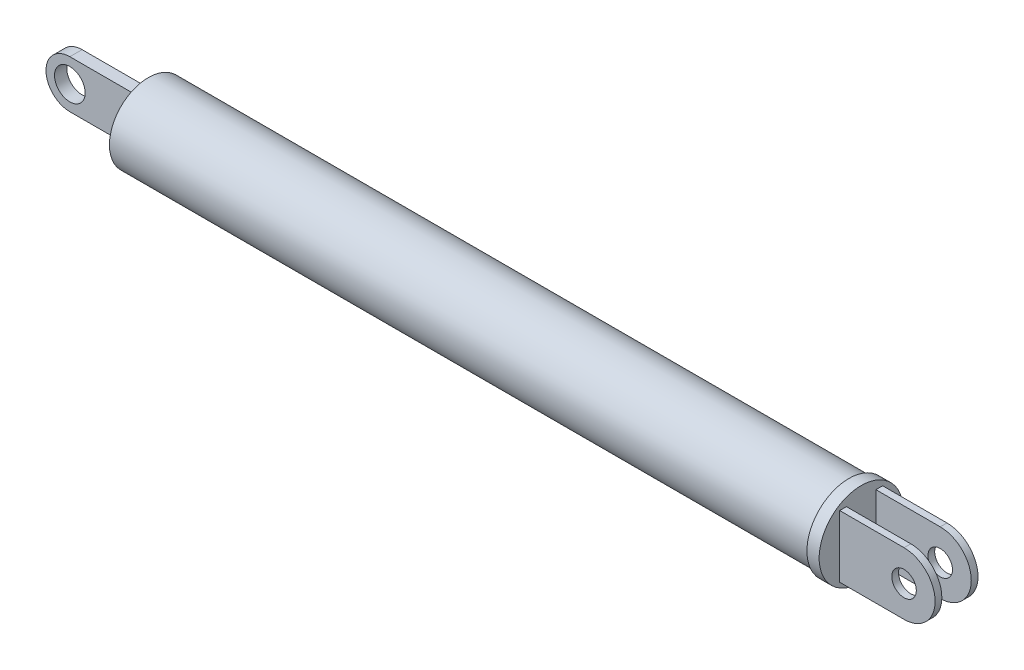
from build123d import *

# Parameters (mm, degrees)
SKETCH1_R               = 12.7
EXTRUDE1_DEPTH          = 228.6
SKETCH2_R               = 5
EXTRUDE2_DEPTH          = 2
SKETCH3_R               = 13.7
EXTRUDE3_DEPTH          = 4
SKETCH4_R               = 4
EXTRUDE4_DEPTH          = 7
CUT_EXTRUDE1_DEPTH      = 265.443561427
CUT_EXTRUDE1_DEPTH_BACK = 265.443561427
SKETCH5_W               = 127.127972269
SKETCH5_H               = 9.602426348


with BuildPart() as part:
    # Sketch1 → Extrude1 (new body)
    with BuildSketch(Plane(origin=(0, 0, 0), x_dir=(0, 0, -1), z_dir=(1, 0, 0))):
        with Locations(Location((0, 0, 0), (0, 0, 180))):
            Circle(SKETCH1_R)
    extrude(amount=EXTRUDE1_DEPTH)

    # Sketch2 → Extrude2 (add, symmetric)
    with BuildSketch(Plane.XY):
        with BuildLine():
            Line((0, 7.778067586), (-23.625125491, 7.778067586))
            ThreePointArc((-23.625125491, 7.778067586), (-31.403193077, 0), (-23.625125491, -7.778067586))
            Line((-23.625125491, -7.778067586), (0, -7.778067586))
            Line((0, -7.778067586), (0, 7.778067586))
        make_face()
        with Locations((-23.625125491, 0)):
            Circle(SKETCH2_R, mode=Mode.SUBTRACT)
    extrude(amount=EXTRUDE2_DEPTH, both=True)

    # Sketch3 → Extrude3 (add)
    with BuildSketch(Plane(origin=(228.6, 0, 0), x_dir=(0, 0, -1), z_dir=(1, 0, 0))):
        Circle(SKETCH3_R)
    extrude(amount=EXTRUDE3_DEPTH)

    # Sketch4 → Extrude4 (add, symmetric)
    with BuildSketch(Plane.XY):
        with BuildLine():
            Line((232.6, 10.132851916), (253.6, 10.132851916))
            ThreePointArc((253.6, 10.132851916), (263.732851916, 0), (253.6, -10.132851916))
            Line((253.6, -10.132851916), (232.6, -10.132851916))
            Line((232.6, -10.132851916), (232.6, 10.132851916))
        make_face()
        with Locations((253.6, 0)):
            Circle(SKETCH4_R, mode=Mode.SUBTRACT)
    extrude(amount=EXTRUDE4_DEPTH, both=True)

    # Sketch5 → Cut-Extrude1 (cut, two sides: drawn at the far end of the back side and taken through both)
    with BuildSketch(Plane(origin=(0, 0, 0), x_dir=(1, 0, 0), z_dir=(0, 1, 0)).offset(-CUT_EXTRUDE1_DEPTH_BACK)):
        with Locations((296.163986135, 0)):
            Rectangle(SKETCH5_W, SKETCH5_H)
    extrude(amount=CUT_EXTRUDE1_DEPTH + CUT_EXTRUDE1_DEPTH_BACK, mode=Mode.SUBTRACT)


solid = part.part
